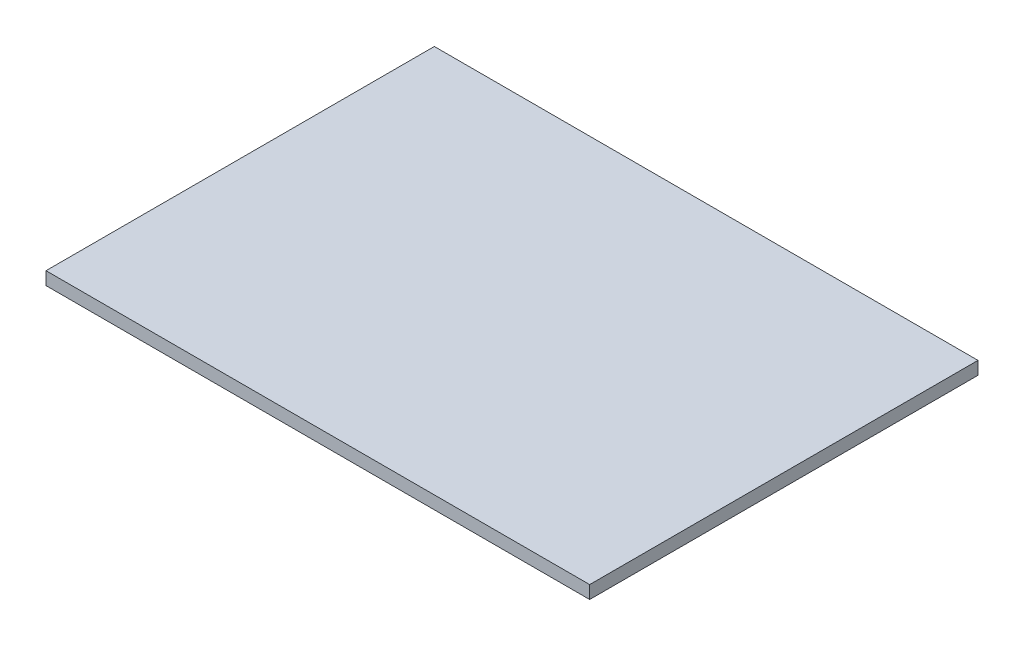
ISO-10303-21;
HEADER;
FILE_DESCRIPTION(('STEP AP214'),'2;1');
FILE_NAME('part.step','',(''),(''),'','','');
FILE_SCHEMA(('AUTOMOTIVE_DESIGN { 1 0 10303 214 1 1 1 1 }'));
ENDSEC;
DATA;
#1=APPLICATION_CONTEXT('core data for automotive mechanical design processes');
#2=APPLICATION_PROTOCOL_DEFINITION('international standard','automotive_design',2000,#1);
#3=PRODUCT_CONTEXT('',#1,'mechanical');
#4=PRODUCT('Part','Part','',(#3));
#5=PRODUCT_RELATED_PRODUCT_CATEGORY('part','',(#4));
#6=PRODUCT_DEFINITION_FORMATION('','',#4);
#7=PRODUCT_DEFINITION_CONTEXT('part definition',#1,'design');
#8=PRODUCT_DEFINITION('design','',#6,#7);
#9=PRODUCT_DEFINITION_SHAPE('','',#8);
#10=(LENGTH_UNIT() NAMED_UNIT(*) SI_UNIT(.MILLI.,.METRE.));
#11=(NAMED_UNIT(*) PLANE_ANGLE_UNIT() SI_UNIT($,.RADIAN.));
#12=(NAMED_UNIT(*) SI_UNIT($,.STERADIAN.) SOLID_ANGLE_UNIT());
#13=UNCERTAINTY_MEASURE_WITH_UNIT(LENGTH_MEASURE(1.E-05),#10,'distance_accuracy_value','');
#14=(GEOMETRIC_REPRESENTATION_CONTEXT(3) GLOBAL_UNCERTAINTY_ASSIGNED_CONTEXT((#13)) GLOBAL_UNIT_ASSIGNED_CONTEXT((#10,
#11,#12)) REPRESENTATION_CONTEXT('',''));
#15=CARTESIAN_POINT('',(0.,0.,0.));
#16=DIRECTION('',(0.,0.,1.));
#17=DIRECTION('',(1.,0.,0.));
#18=AXIS2_PLACEMENT_3D('',#15,#16,#17);
#19=CARTESIAN_POINT('',(21.,0.5,15.));
#20=DIRECTION('',(-1.,0.,0.));
#21=DIRECTION('',(0.,0.,1.));
#22=AXIS2_PLACEMENT_3D('',#19,#20,#21);
#23=PLANE('',#22);
#24=DIRECTION('',(0.,0.,-1.));
#25=VECTOR('',#24,1.);
#26=CARTESIAN_POINT('',(21.,-0.5,15.));
#27=LINE('',#26,#25);
#28=CARTESIAN_POINT('',(21.,-0.5,15.));
#29=VERTEX_POINT('',#28);
#30=CARTESIAN_POINT('',(21.,-0.5,-15.));
#31=VERTEX_POINT('',#30);
#32=EDGE_CURVE('E107',#29,#31,#27,.T.);
#33=ORIENTED_EDGE('',*,*,#32,.T.);
#34=DIRECTION('',(0.,-1.,0.));
#35=VECTOR('',#34,1.);
#36=CARTESIAN_POINT('',(21.,0.5,-15.));
#37=LINE('',#36,#35);
#38=CARTESIAN_POINT('',(21.,0.5,-15.));
#39=VERTEX_POINT('',#38);
#40=EDGE_CURVE('E11',#39,#31,#37,.T.);
#41=ORIENTED_EDGE('',*,*,#40,.F.);
#42=DIRECTION('',(0.,0.,-1.));
#43=VECTOR('',#42,1.);
#44=CARTESIAN_POINT('',(21.,0.5,15.));
#45=LINE('',#44,#43);
#46=CARTESIAN_POINT('',(21.,0.5,15.));
#47=VERTEX_POINT('',#46);
#48=EDGE_CURVE('E91',#47,#39,#45,.T.);
#49=ORIENTED_EDGE('',*,*,#48,.F.);
#50=DIRECTION('',(0.,-1.,0.));
#51=VECTOR('',#50,1.);
#52=CARTESIAN_POINT('',(21.,0.5,15.));
#53=LINE('',#52,#51);
#54=EDGE_CURVE('E103',#47,#29,#53,.T.);
#55=ORIENTED_EDGE('',*,*,#54,.T.);
#56=EDGE_LOOP('',(#33,#41,#49,#55));
#57=FACE_BOUND('',#56,.T.);
#58=ADVANCED_FACE('F39',(#57),#23,.F.);
#59=CARTESIAN_POINT('',(-21.,0.5,-15.));
#60=DIRECTION('',(0.,0.,1.));
#61=DIRECTION('',(1.,0.,0.));
#62=AXIS2_PLACEMENT_3D('',#59,#60,#61);
#63=PLANE('',#62);
#64=DIRECTION('',(-1.,0.,0.));
#65=VECTOR('',#64,1.);
#66=CARTESIAN_POINT('',(-21.,-0.5,-15.));
#67=LINE('',#66,#65);
#68=CARTESIAN_POINT('',(-21.,-0.5,-15.));
#69=VERTEX_POINT('',#68);
#70=EDGE_CURVE('E96',#31,#69,#67,.T.);
#71=ORIENTED_EDGE('',*,*,#70,.T.);
#72=DIRECTION('',(0.,-1.,0.));
#73=VECTOR('',#72,1.);
#74=CARTESIAN_POINT('',(-21.,0.5,-15.));
#75=LINE('',#74,#73);
#76=CARTESIAN_POINT('',(-21.,0.5,-15.));
#77=VERTEX_POINT('',#76);
#78=EDGE_CURVE('E48',#77,#69,#75,.T.);
#79=ORIENTED_EDGE('',*,*,#78,.F.);
#80=DIRECTION('',(-1.,0.,0.));
#81=VECTOR('',#80,1.);
#82=CARTESIAN_POINT('',(-21.,0.5,-15.));
#83=LINE('',#82,#81);
#84=EDGE_CURVE('E86',#39,#77,#83,.T.);
#85=ORIENTED_EDGE('',*,*,#84,.F.);
#86=ORIENTED_EDGE('',*,*,#40,.T.);
#87=EDGE_LOOP('',(#71,#79,#85,#86));
#88=FACE_BOUND('',#87,.T.);
#89=ADVANCED_FACE('F95',(#88),#63,.F.);
#90=CARTESIAN_POINT('',(-21.,0.5,15.));
#91=DIRECTION('',(1.,0.,0.));
#92=DIRECTION('',(0.,0.,-1.));
#93=AXIS2_PLACEMENT_3D('',#90,#91,#92);
#94=PLANE('',#93);
#95=DIRECTION('',(0.,0.,1.));
#96=VECTOR('',#95,1.);
#97=CARTESIAN_POINT('',(-21.,-0.5,15.));
#98=LINE('',#97,#96);
#99=CARTESIAN_POINT('',(-21.,-0.5,15.));
#100=VERTEX_POINT('',#99);
#101=EDGE_CURVE('E73',#69,#100,#98,.T.);
#102=ORIENTED_EDGE('',*,*,#101,.T.);
#103=DIRECTION('',(0.,-1.,0.));
#104=VECTOR('',#103,1.);
#105=CARTESIAN_POINT('',(-21.,0.5,15.));
#106=LINE('',#105,#104);
#107=CARTESIAN_POINT('',(-21.,0.5,15.));
#108=VERTEX_POINT('',#107);
#109=EDGE_CURVE('E98',#108,#100,#106,.T.);
#110=ORIENTED_EDGE('',*,*,#109,.F.);
#111=DIRECTION('',(0.,0.,1.));
#112=VECTOR('',#111,1.);
#113=CARTESIAN_POINT('',(-21.,0.5,15.));
#114=LINE('',#113,#112);
#115=EDGE_CURVE('E89',#77,#108,#114,.T.);
#116=ORIENTED_EDGE('',*,*,#115,.F.);
#117=ORIENTED_EDGE('',*,*,#78,.T.);
#118=EDGE_LOOP('',(#102,#110,#116,#117));
#119=FACE_BOUND('',#118,.T.);
#120=ADVANCED_FACE('F99',(#119),#94,.F.);
#121=CARTESIAN_POINT('',(-21.,0.5,15.));
#122=DIRECTION('',(0.,0.,-1.));
#123=DIRECTION('',(-1.,0.,0.));
#124=AXIS2_PLACEMENT_3D('',#121,#122,#123);
#125=PLANE('',#124);
#126=DIRECTION('',(1.,0.,0.));
#127=VECTOR('',#126,1.);
#128=CARTESIAN_POINT('',(-21.,-0.5,15.));
#129=LINE('',#128,#127);
#130=EDGE_CURVE('E79',#100,#29,#129,.T.);
#131=ORIENTED_EDGE('',*,*,#130,.T.);
#132=ORIENTED_EDGE('',*,*,#54,.F.);
#133=DIRECTION('',(1.,0.,0.));
#134=VECTOR('',#133,1.);
#135=CARTESIAN_POINT('',(-21.,0.5,15.));
#136=LINE('',#135,#134);
#137=EDGE_CURVE('E56',#108,#47,#136,.T.);
#138=ORIENTED_EDGE('',*,*,#137,.F.);
#139=ORIENTED_EDGE('',*,*,#109,.T.);
#140=EDGE_LOOP('',(#131,#132,#138,#139));
#141=FACE_BOUND('',#140,.T.);
#142=ADVANCED_FACE('F120',(#141),#125,.F.);
#143=CARTESIAN_POINT('',(0.,0.5,0.));
#144=DIRECTION('',(0.,-1.,0.));
#145=DIRECTION('',(0.,0.,-1.));
#146=AXIS2_PLACEMENT_3D('',#143,#144,#145);
#147=PLANE('',#146);
#148=ORIENTED_EDGE('',*,*,#48,.T.);
#149=ORIENTED_EDGE('',*,*,#84,.T.);
#150=ORIENTED_EDGE('',*,*,#115,.T.);
#151=ORIENTED_EDGE('',*,*,#137,.T.);
#152=EDGE_LOOP('',(#148,#149,#150,#151));
#153=FACE_BOUND('',#152,.T.);
#154=ADVANCED_FACE('F87',(#153),#147,.F.);
#155=CARTESIAN_POINT('',(0.,-0.5,0.));
#156=DIRECTION('',(0.,-1.,0.));
#157=DIRECTION('',(0.,0.,-1.));
#158=AXIS2_PLACEMENT_3D('',#155,#156,#157);
#159=PLANE('',#158);
#160=ORIENTED_EDGE('',*,*,#32,.F.);
#161=ORIENTED_EDGE('',*,*,#130,.F.);
#162=ORIENTED_EDGE('',*,*,#101,.F.);
#163=ORIENTED_EDGE('',*,*,#70,.F.);
#164=EDGE_LOOP('',(#160,#161,#162,#163));
#165=FACE_BOUND('',#164,.T.);
#166=ADVANCED_FACE('F123',(#165),#159,.T.);
#167=CLOSED_SHELL('',(#58,#89,#120,#142,#154,#166));
#168=MANIFOLD_SOLID_BREP('B2',#167);
#169=ADVANCED_BREP_SHAPE_REPRESENTATION('',(#18,#168),#14);
#170=SHAPE_DEFINITION_REPRESENTATION(#9,#169);
ENDSEC;
END-ISO-10303-21;
